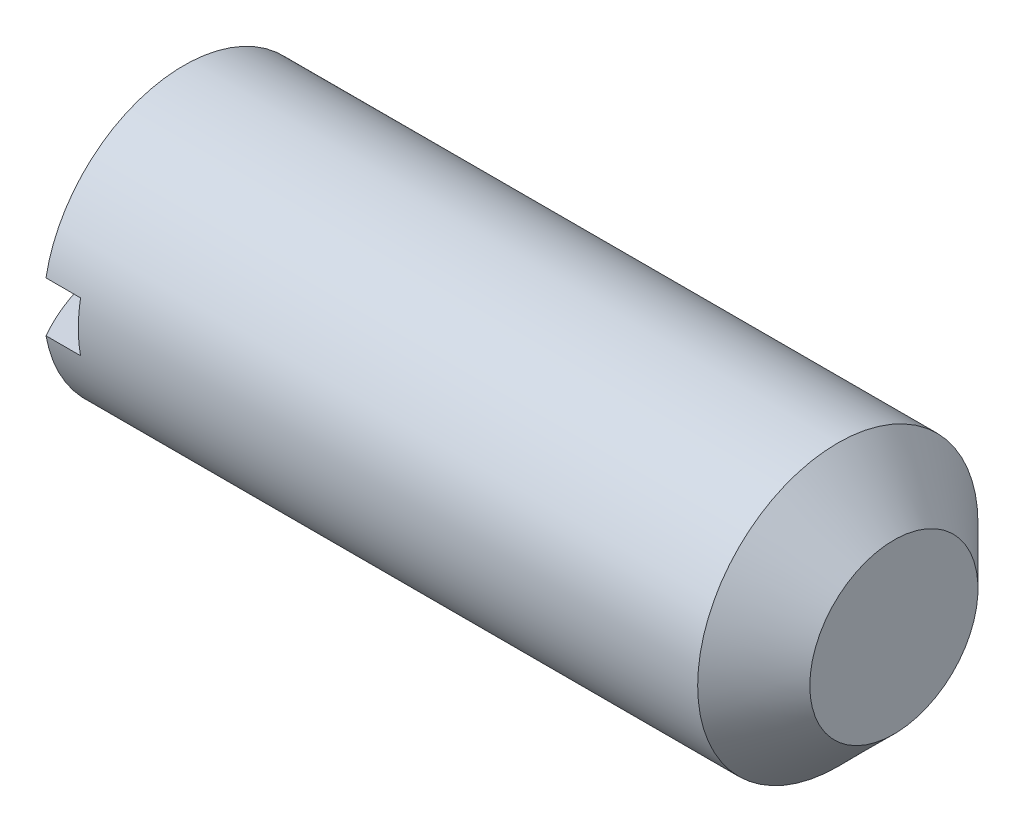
from build123d import *

# Parameters (mm, degrees)
SKETCH2_W  = 19.05
SKETCH2_H  = 3.4036
SLOT_DEPTH = 4.9022


with BuildPart() as part:
    # BodySke → BaseBody (revolve)
    with BuildSketch(Plane.XY, mode=Mode.PRIVATE) as basebody_sk:
        with BuildLine():
            Line((50.8, 0), (50.8, 5.715))
            Line((50.8, 5.715), (46.99, 9.525))
            Line((46.99, 9.525), (2.552216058, 9.525))
            ThreePointArc((2.552216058, 9.525), (0.649113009, 4.930502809), (0, 0))
            Line((0, 0), (50.8, 0))
        make_face()
    revolve(basebody_sk.sketch.rotate(Axis((-12.7, 0, 0), (1, 0, 0)), 90), axis=Axis((-12.7, 0, 0), (1, 0, 0)))

    # Sketch2 → Slot (cut)
    with BuildSketch(Plane(origin=(0, 0, 0), x_dir=(0, 0, -1), z_dir=(1, 0, 0))):
        Rectangle(SKETCH2_W, SKETCH2_H)
    extrude(amount=SLOT_DEPTH, mode=Mode.SUBTRACT)


solid = part.part
